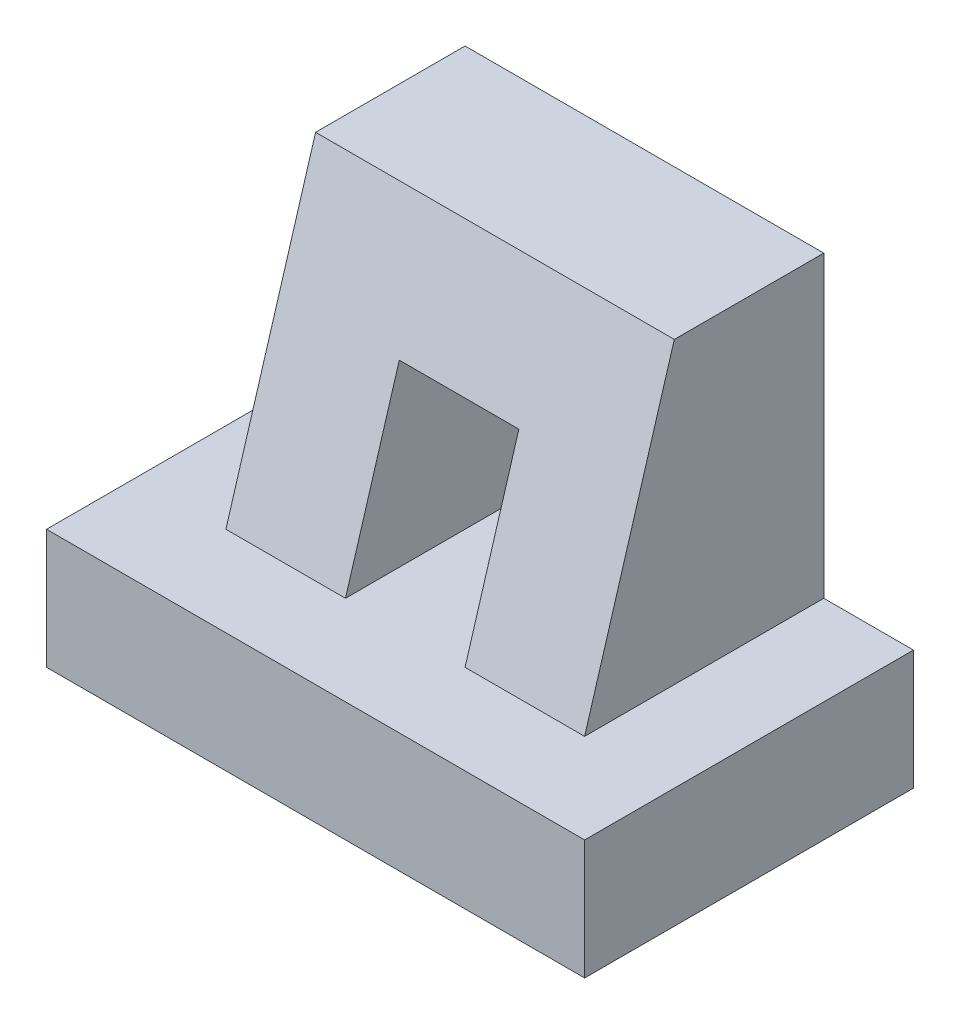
from build123d import *

# Parameters (mm, degrees)
SKETCH_1_W          = 90
SKETCH_1_H          = 55
EXTRUDE_1_DEPTH     = 20
EXTRUDE_2_DEPTH     = 30
SKETCH_3_W          = 20
SKETCH_3_H          = 30
CUT_EXTRUDE_1_DEPTH = 127.589889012


with BuildPart() as part:
    # Sketch 1 → Extrude 1 (new body)
    with BuildSketch(Plane(origin=(0, 0, 0), x_dir=(1, 0, 0), z_dir=(0, 1, 0))):
        with Locations((45, 27.5)):
            Rectangle(SKETCH_1_W, SKETCH_1_H)
    extrude(amount=EXTRUDE_1_DEPTH)

    # Sketch 2 → Extrude 2 (add, symmetric)
    with BuildSketch(Plane(origin=(45, 0, 0), x_dir=(0, 0, -1), z_dir=(1, 0, 0))):
        Polygon((55, 20), (15, 20), (30, 70), (55, 70), align=None)
    extrude(amount=EXTRUDE_2_DEPTH, both=True)

    # Sketch 3 → Cut-Extrude 1 (cut, through all)
    with BuildSketch(Plane.XY):
        with Locations((45, 35)):
            Rectangle(SKETCH_3_W, SKETCH_3_H)
    extrude(amount=-CUT_EXTRUDE_1_DEPTH, mode=Mode.SUBTRACT)


solid = part.part
